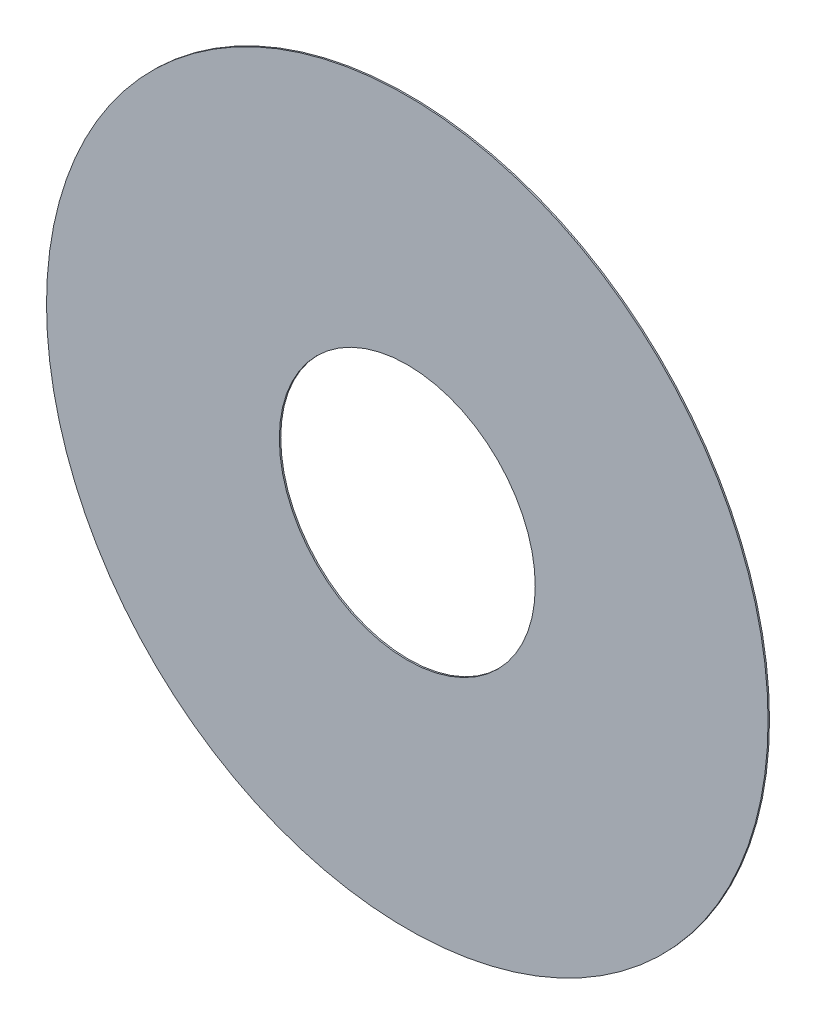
ISO-10303-21;
HEADER;
FILE_DESCRIPTION(('STEP AP214'),'2;1');
FILE_NAME('part.step','',(''),(''),'','','');
FILE_SCHEMA(('AUTOMOTIVE_DESIGN { 1 0 10303 214 1 1 1 1 }'));
ENDSEC;
DATA;
#1=APPLICATION_CONTEXT('core data for automotive mechanical design processes');
#2=APPLICATION_PROTOCOL_DEFINITION('international standard','automotive_design',2000,#1);
#3=PRODUCT_CONTEXT('',#1,'mechanical');
#4=PRODUCT('Part','Part','',(#3));
#5=PRODUCT_RELATED_PRODUCT_CATEGORY('part','',(#4));
#6=PRODUCT_DEFINITION_FORMATION('','',#4);
#7=PRODUCT_DEFINITION_CONTEXT('part definition',#1,'design');
#8=PRODUCT_DEFINITION('design','',#6,#7);
#9=PRODUCT_DEFINITION_SHAPE('','',#8);
#10=(LENGTH_UNIT() NAMED_UNIT(*) SI_UNIT(.MILLI.,.METRE.));
#11=(NAMED_UNIT(*) PLANE_ANGLE_UNIT() SI_UNIT($,.RADIAN.));
#12=(NAMED_UNIT(*) SI_UNIT($,.STERADIAN.) SOLID_ANGLE_UNIT());
#13=UNCERTAINTY_MEASURE_WITH_UNIT(LENGTH_MEASURE(1.E-05),#10,'distance_accuracy_value','');
#14=(GEOMETRIC_REPRESENTATION_CONTEXT(3) GLOBAL_UNCERTAINTY_ASSIGNED_CONTEXT((#13)) GLOBAL_UNIT_ASSIGNED_CONTEXT((#10,
#11,#12)) REPRESENTATION_CONTEXT('',''));
#15=CARTESIAN_POINT('',(0.,0.,0.));
#16=DIRECTION('',(0.,0.,1.));
#17=DIRECTION('',(1.,0.,0.));
#18=AXIS2_PLACEMENT_3D('',#15,#16,#17);
#19=CARTESIAN_POINT('',(0.,0.,-2.));
#20=DIRECTION('',(0.,0.,1.));
#21=DIRECTION('',(1.,0.,0.));
#22=AXIS2_PLACEMENT_3D('',#19,#20,#21);
#23=CYLINDRICAL_SURFACE('',#22,507.5);
#24=CARTESIAN_POINT('',(0.,0.,-2.));
#25=DIRECTION('',(0.,0.,1.));
#26=DIRECTION('',(1.,0.,0.));
#27=AXIS2_PLACEMENT_3D('',#24,#25,#26);
#28=CIRCLE('',#27,507.5);
#29=CARTESIAN_POINT('',(507.5,0.,-2.));
#30=VERTEX_POINT('',#29);
#31=EDGE_CURVE('E10',#30,#30,#28,.T.);
#32=ORIENTED_EDGE('',*,*,#31,.T.);
#33=EDGE_LOOP('',(#32));
#34=FACE_BOUND('',#33,.T.);
#35=CARTESIAN_POINT('',(0.,0.,0.));
#36=DIRECTION('',(0.,0.,1.));
#37=DIRECTION('',(1.,0.,0.));
#38=AXIS2_PLACEMENT_3D('',#35,#36,#37);
#39=CIRCLE('',#38,507.5);
#40=CARTESIAN_POINT('',(507.5,0.,0.));
#41=VERTEX_POINT('',#40);
#42=EDGE_CURVE('E39',#41,#41,#39,.T.);
#43=ORIENTED_EDGE('',*,*,#42,.F.);
#44=EDGE_LOOP('',(#43));
#45=FACE_BOUND('',#44,.T.);
#46=ADVANCED_FACE('F36',(#34,#45),#23,.T.);
#47=CARTESIAN_POINT('',(0.,0.,-2.));
#48=DIRECTION('',(0.,0.,1.));
#49=DIRECTION('',(1.,0.,0.));
#50=AXIS2_PLACEMENT_3D('',#47,#48,#49);
#51=PLANE('',#50);
#52=CARTESIAN_POINT('',(0.,0.,-2.));
#53=DIRECTION('',(0.,0.,1.));
#54=DIRECTION('',(1.,0.,0.));
#55=AXIS2_PLACEMENT_3D('',#52,#53,#54);
#56=CIRCLE('',#55,180.);
#57=CARTESIAN_POINT('',(180.,0.,-2.));
#58=VERTEX_POINT('',#57);
#59=EDGE_CURVE('E46',#58,#58,#56,.T.);
#60=ORIENTED_EDGE('',*,*,#59,.T.);
#61=EDGE_LOOP('',(#60));
#62=FACE_BOUND('',#61,.T.);
#63=ORIENTED_EDGE('',*,*,#31,.F.);
#64=EDGE_LOOP('',(#63));
#65=FACE_BOUND('',#64,.T.);
#66=ADVANCED_FACE('F60',(#62,#65),#51,.F.);
#67=CARTESIAN_POINT('',(0.,0.,0.));
#68=DIRECTION('',(0.,0.,1.));
#69=DIRECTION('',(1.,0.,0.));
#70=AXIS2_PLACEMENT_3D('',#67,#68,#69);
#71=PLANE('',#70);
#72=CARTESIAN_POINT('',(0.,0.,0.));
#73=DIRECTION('',(0.,0.,1.));
#74=DIRECTION('',(1.,0.,0.));
#75=AXIS2_PLACEMENT_3D('',#72,#73,#74);
#76=CIRCLE('',#75,180.);
#77=CARTESIAN_POINT('',(180.,0.,0.));
#78=VERTEX_POINT('',#77);
#79=EDGE_CURVE('E50',#78,#78,#76,.T.);
#80=ORIENTED_EDGE('',*,*,#79,.F.);
#81=EDGE_LOOP('',(#80));
#82=FACE_BOUND('',#81,.T.);
#83=ORIENTED_EDGE('',*,*,#42,.T.);
#84=EDGE_LOOP('',(#83));
#85=FACE_BOUND('',#84,.T.);
#86=ADVANCED_FACE('F57',(#82,#85),#71,.T.);
#87=CARTESIAN_POINT('',(0.,0.,-10.));
#88=DIRECTION('',(0.,0.,1.));
#89=DIRECTION('',(1.,0.,0.));
#90=AXIS2_PLACEMENT_3D('',#87,#88,#89);
#91=CYLINDRICAL_SURFACE('',#90,180.);
#92=ORIENTED_EDGE('',*,*,#79,.T.);
#93=EDGE_LOOP('',(#92));
#94=FACE_BOUND('',#93,.T.);
#95=ORIENTED_EDGE('',*,*,#59,.F.);
#96=EDGE_LOOP('',(#95));
#97=FACE_BOUND('',#96,.T.);
#98=ADVANCED_FACE('F54',(#94,#97),#91,.F.);
#99=CLOSED_SHELL('',(#46,#66,#86,#98));
#100=MANIFOLD_SOLID_BREP('B2',#99);
#101=ADVANCED_BREP_SHAPE_REPRESENTATION('',(#18,#100),#14);
#102=SHAPE_DEFINITION_REPRESENTATION(#9,#101);
ENDSEC;
END-ISO-10303-21;
